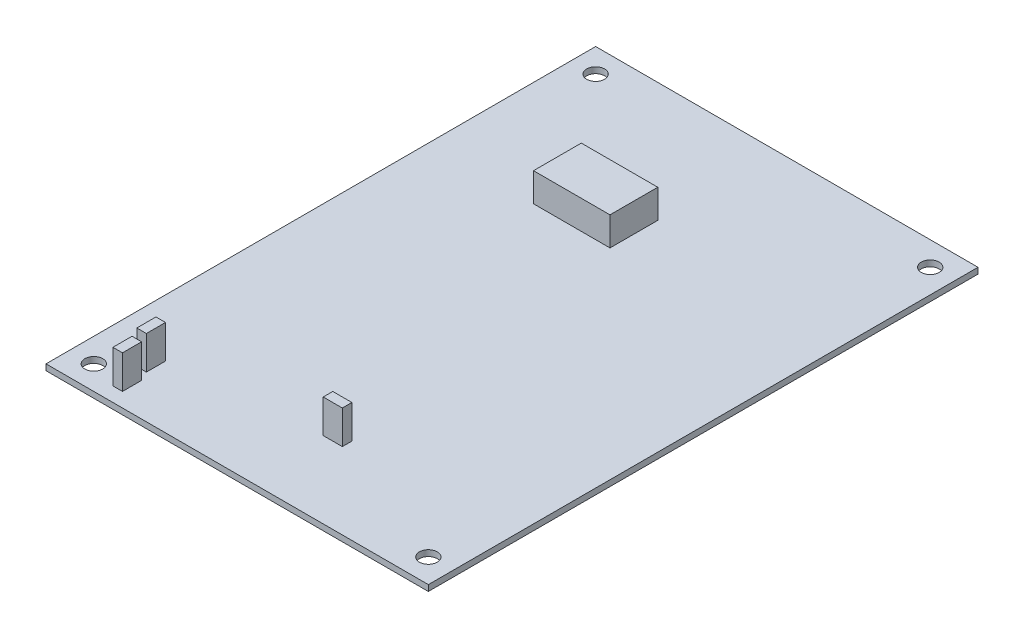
ISO-10303-21;
HEADER;
FILE_DESCRIPTION(('STEP AP214'),'2;1');
FILE_NAME('part.step','',(''),(''),'','','');
FILE_SCHEMA(('AUTOMOTIVE_DESIGN { 1 0 10303 214 1 1 1 1 }'));
ENDSEC;
DATA;
#1=APPLICATION_CONTEXT('core data for automotive mechanical design processes');
#2=APPLICATION_PROTOCOL_DEFINITION('international standard','automotive_design',2000,#1);
#3=PRODUCT_CONTEXT('',#1,'mechanical');
#4=PRODUCT('Part','Part','',(#3));
#5=PRODUCT_RELATED_PRODUCT_CATEGORY('part','',(#4));
#6=PRODUCT_DEFINITION_FORMATION('','',#4);
#7=PRODUCT_DEFINITION_CONTEXT('part definition',#1,'design');
#8=PRODUCT_DEFINITION('design','',#6,#7);
#9=PRODUCT_DEFINITION_SHAPE('','',#8);
#10=(LENGTH_UNIT() NAMED_UNIT(*) SI_UNIT(.MILLI.,.METRE.));
#11=(NAMED_UNIT(*) PLANE_ANGLE_UNIT() SI_UNIT($,.RADIAN.));
#12=(NAMED_UNIT(*) SI_UNIT($,.STERADIAN.) SOLID_ANGLE_UNIT());
#13=UNCERTAINTY_MEASURE_WITH_UNIT(LENGTH_MEASURE(1.E-05),#10,'distance_accuracy_value','');
#14=(GEOMETRIC_REPRESENTATION_CONTEXT(3) GLOBAL_UNCERTAINTY_ASSIGNED_CONTEXT((#13)) GLOBAL_UNIT_ASSIGNED_CONTEXT((#10,
#11,#12)) REPRESENTATION_CONTEXT('',''));
#15=CARTESIAN_POINT('',(0.,0.,0.));
#16=DIRECTION('',(0.,0.,1.));
#17=DIRECTION('',(1.,0.,0.));
#18=AXIS2_PLACEMENT_3D('',#15,#16,#17);
#19=CARTESIAN_POINT('',(-50.8,1.5875,73.025));
#20=DIRECTION('',(0.,1.,0.));
#21=DIRECTION('',(0.,0.,1.));
#22=AXIS2_PLACEMENT_3D('',#19,#20,#21);
#23=PLANE('',#22);
#24=DIRECTION('',(1.,0.,0.));
#25=VECTOR('',#24,1.);
#26=CARTESIAN_POINT('',(-38.1,1.5875,61.595));
#27=LINE('',#26,#25);
#28=CARTESIAN_POINT('',(-38.1,1.5875,61.595));
#29=VERTEX_POINT('',#28);
#30=CARTESIAN_POINT('',(-35.56,1.5875,61.595));
#31=VERTEX_POINT('',#30);
#32=EDGE_CURVE('E213',#29,#31,#27,.T.);
#33=ORIENTED_EDGE('',*,*,#32,.F.);
#34=DIRECTION('',(0.,0.,1.));
#35=VECTOR('',#34,1.);
#36=CARTESIAN_POINT('',(-38.1,1.5875,56.515));
#37=LINE('',#36,#35);
#38=CARTESIAN_POINT('',(-38.1,1.5875,56.515));
#39=VERTEX_POINT('',#38);
#40=EDGE_CURVE('E210',#39,#29,#37,.T.);
#41=ORIENTED_EDGE('',*,*,#40,.F.);
#42=DIRECTION('',(-1.,0.,0.));
#43=VECTOR('',#42,1.);
#44=CARTESIAN_POINT('',(-38.1,1.5875,56.515));
#45=LINE('',#44,#43);
#46=CARTESIAN_POINT('',(-35.56,1.5875,56.515));
#47=VERTEX_POINT('',#46);
#48=EDGE_CURVE('E223',#47,#39,#45,.T.);
#49=ORIENTED_EDGE('',*,*,#48,.F.);
#50=DIRECTION('',(0.,0.,-1.));
#51=VECTOR('',#50,1.);
#52=CARTESIAN_POINT('',(-35.56,1.5875,56.515));
#53=LINE('',#52,#51);
#54=EDGE_CURVE('E233',#31,#47,#53,.T.);
#55=ORIENTED_EDGE('',*,*,#54,.F.);
#56=EDGE_LOOP('',(#33,#41,#49,#55));
#57=FACE_BOUND('',#56,.T.);
#58=DIRECTION('',(1.,0.,0.));
#59=VECTOR('',#58,1.);
#60=CARTESIAN_POINT('',(-22.86,1.5875,-28.575));
#61=LINE('',#60,#59);
#62=CARTESIAN_POINT('',(-22.86,1.5875,-28.575));
#63=VERTEX_POINT('',#62);
#64=CARTESIAN_POINT('',(-2.53999999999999,1.5875,-28.575));
#65=VERTEX_POINT('',#64);
#66=EDGE_CURVE('E297',#63,#65,#61,.T.);
#67=ORIENTED_EDGE('',*,*,#66,.F.);
#68=DIRECTION('',(0.,0.,1.));
#69=VECTOR('',#68,1.);
#70=CARTESIAN_POINT('',(-22.86,1.5875,-41.275));
#71=LINE('',#70,#69);
#72=CARTESIAN_POINT('',(-22.86,1.5875,-41.275));
#73=VERTEX_POINT('',#72);
#74=EDGE_CURVE('E283',#73,#63,#71,.T.);
#75=ORIENTED_EDGE('',*,*,#74,.F.);
#76=DIRECTION('',(-1.,0.,0.));
#77=VECTOR('',#76,1.);
#78=CARTESIAN_POINT('',(-22.86,1.5875,-41.275));
#79=LINE('',#78,#77);
#80=CARTESIAN_POINT('',(-2.53999999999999,1.5875,-41.275));
#81=VERTEX_POINT('',#80);
#82=EDGE_CURVE('E288',#81,#73,#79,.T.);
#83=ORIENTED_EDGE('',*,*,#82,.F.);
#84=DIRECTION('',(0.,0.,-1.));
#85=VECTOR('',#84,1.);
#86=CARTESIAN_POINT('',(-2.53999999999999,1.5875,-41.275));
#87=LINE('',#86,#85);
#88=EDGE_CURVE('E299',#65,#81,#87,.T.);
#89=ORIENTED_EDGE('',*,*,#88,.F.);
#90=EDGE_LOOP('',(#67,#75,#83,#89));
#91=FACE_BOUND('',#90,.T.);
#92=CARTESIAN_POINT('',(44.45,1.5875,66.675));
#93=DIRECTION('',(0.,1.,0.));
#94=DIRECTION('',(0.,0.,1.));
#95=AXIS2_PLACEMENT_3D('',#92,#93,#94);
#96=CIRCLE('',#95,2.38125);
#97=CARTESIAN_POINT('',(44.45,1.5875,69.05625));
#98=VERTEX_POINT('',#97);
#99=EDGE_CURVE('E319',#98,#98,#96,.T.);
#100=ORIENTED_EDGE('',*,*,#99,.F.);
#101=EDGE_LOOP('',(#100));
#102=FACE_BOUND('',#101,.T.);
#103=CARTESIAN_POINT('',(-44.45,1.5875,-66.675));
#104=DIRECTION('',(0.,1.,0.));
#105=DIRECTION('',(0.,0.,1.));
#106=AXIS2_PLACEMENT_3D('',#103,#104,#105);
#107=CIRCLE('',#106,2.38125);
#108=CARTESIAN_POINT('',(-44.45,1.5875,-64.29375));
#109=VERTEX_POINT('',#108);
#110=EDGE_CURVE('E333',#109,#109,#107,.T.);
#111=ORIENTED_EDGE('',*,*,#110,.F.);
#112=EDGE_LOOP('',(#111));
#113=FACE_BOUND('',#112,.T.);
#114=DIRECTION('',(0.,0.,1.));
#115=VECTOR('',#114,1.);
#116=CARTESIAN_POINT('',(-50.8,1.5875,-73.025));
#117=LINE('',#116,#115);
#118=CARTESIAN_POINT('',(-50.8,1.5875,-73.025));
#119=VERTEX_POINT('',#118);
#120=CARTESIAN_POINT('',(-50.8,1.5875,73.025));
#121=VERTEX_POINT('',#120);
#122=EDGE_CURVE('E341',#119,#121,#117,.T.);
#123=ORIENTED_EDGE('',*,*,#122,.T.);
#124=DIRECTION('',(1.,0.,0.));
#125=VECTOR('',#124,1.);
#126=CARTESIAN_POINT('',(-50.8,1.5875,73.025));
#127=LINE('',#126,#125);
#128=CARTESIAN_POINT('',(50.8,1.5875,73.025));
#129=VERTEX_POINT('',#128);
#130=EDGE_CURVE('E345',#121,#129,#127,.T.);
#131=ORIENTED_EDGE('',*,*,#130,.T.);
#132=DIRECTION('',(0.,0.,-1.));
#133=VECTOR('',#132,1.);
#134=CARTESIAN_POINT('',(50.8,1.5875,-73.025));
#135=LINE('',#134,#133);
#136=CARTESIAN_POINT('',(50.8,1.5875,-73.025));
#137=VERTEX_POINT('',#136);
#138=EDGE_CURVE('E348',#129,#137,#135,.T.);
#139=ORIENTED_EDGE('',*,*,#138,.T.);
#140=DIRECTION('',(-1.,0.,0.));
#141=VECTOR('',#140,1.);
#142=CARTESIAN_POINT('',(-50.8,1.5875,-73.025));
#143=LINE('',#142,#141);
#144=EDGE_CURVE('E351',#137,#119,#143,.T.);
#145=ORIENTED_EDGE('',*,*,#144,.T.);
#146=EDGE_LOOP('',(#123,#131,#139,#145));
#147=FACE_BOUND('',#146,.T.);
#148=CARTESIAN_POINT('',(44.45,1.5875,-66.675));
#149=DIRECTION('',(0.,1.,0.));
#150=DIRECTION('',(0.,0.,1.));
#151=AXIS2_PLACEMENT_3D('',#148,#149,#150);
#152=CIRCLE('',#151,2.38125);
#153=CARTESIAN_POINT('',(44.45,1.5875,-64.29375));
#154=VERTEX_POINT('',#153);
#155=EDGE_CURVE('E325',#154,#154,#152,.T.);
#156=ORIENTED_EDGE('',*,*,#155,.F.);
#157=EDGE_LOOP('',(#156));
#158=FACE_BOUND('',#157,.T.);
#159=CARTESIAN_POINT('',(-44.45,1.5875,66.675));
#160=DIRECTION('',(0.,1.,0.));
#161=DIRECTION('',(0.,0.,1.));
#162=AXIS2_PLACEMENT_3D('',#159,#160,#161);
#163=CIRCLE('',#162,2.38125);
#164=CARTESIAN_POINT('',(-44.45,1.5875,69.05625));
#165=VERTEX_POINT('',#164);
#166=EDGE_CURVE('E313',#165,#165,#163,.T.);
#167=ORIENTED_EDGE('',*,*,#166,.F.);
#168=EDGE_LOOP('',(#167));
#169=FACE_BOUND('',#168,.T.);
#170=DIRECTION('',(1.,0.,0.));
#171=VECTOR('',#170,1.);
#172=CARTESIAN_POINT('',(2.54000000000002,1.5875,52.705));
#173=LINE('',#172,#171);
#174=CARTESIAN_POINT('',(2.54000000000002,1.5875,52.705));
#175=VERTEX_POINT('',#174);
#176=CARTESIAN_POINT('',(7.62000000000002,1.5875,52.705));
#177=VERTEX_POINT('',#176);
#178=EDGE_CURVE('E264',#175,#177,#173,.T.);
#179=ORIENTED_EDGE('',*,*,#178,.F.);
#180=DIRECTION('',(0.,0.,1.));
#181=VECTOR('',#180,1.);
#182=CARTESIAN_POINT('',(2.54000000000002,1.5875,50.165));
#183=LINE('',#182,#181);
#184=CARTESIAN_POINT('',(2.54000000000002,1.5875,50.165));
#185=VERTEX_POINT('',#184);
#186=EDGE_CURVE('E246',#185,#175,#183,.T.);
#187=ORIENTED_EDGE('',*,*,#186,.F.);
#188=DIRECTION('',(-1.,0.,0.));
#189=VECTOR('',#188,1.);
#190=CARTESIAN_POINT('',(2.54000000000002,1.5875,50.165));
#191=LINE('',#190,#189);
#192=CARTESIAN_POINT('',(7.62000000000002,1.5875,50.165));
#193=VERTEX_POINT('',#192);
#194=EDGE_CURVE('E252',#193,#185,#191,.T.);
#195=ORIENTED_EDGE('',*,*,#194,.F.);
#196=DIRECTION('',(0.,0.,-1.));
#197=VECTOR('',#196,1.);
#198=CARTESIAN_POINT('',(7.62000000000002,1.5875,50.165));
#199=LINE('',#198,#197);
#200=EDGE_CURVE('E266',#177,#193,#199,.T.);
#201=ORIENTED_EDGE('',*,*,#200,.F.);
#202=EDGE_LOOP('',(#179,#187,#195,#201));
#203=FACE_BOUND('',#202,.T.);
#204=DIRECTION('',(1.,0.,0.));
#205=VECTOR('',#204,1.);
#206=CARTESIAN_POINT('',(-36.83,1.5875,69.215));
#207=LINE('',#206,#205);
#208=CARTESIAN_POINT('',(-36.83,1.5875,69.215));
#209=VERTEX_POINT('',#208);
#210=CARTESIAN_POINT('',(-34.29,1.5875,69.215));
#211=VERTEX_POINT('',#210);
#212=EDGE_CURVE('E685',#209,#211,#207,.T.);
#213=ORIENTED_EDGE('',*,*,#212,.F.);
#214=DIRECTION('',(0.,0.,1.));
#215=VECTOR('',#214,1.);
#216=CARTESIAN_POINT('',(-36.83,1.5875,64.135));
#217=LINE('',#216,#215);
#218=CARTESIAN_POINT('',(-36.83,1.5875,64.135));
#219=VERTEX_POINT('',#218);
#220=EDGE_CURVE('E208',#219,#209,#217,.T.);
#221=ORIENTED_EDGE('',*,*,#220,.F.);
#222=DIRECTION('',(-1.,0.,0.));
#223=VECTOR('',#222,1.);
#224=CARTESIAN_POINT('',(-36.83,1.5875,64.135));
#225=LINE('',#224,#223);
#226=CARTESIAN_POINT('',(-34.29,1.5875,64.135));
#227=VERTEX_POINT('',#226);
#228=EDGE_CURVE('E204',#227,#219,#225,.T.);
#229=ORIENTED_EDGE('',*,*,#228,.F.);
#230=DIRECTION('',(0.,0.,-1.));
#231=VECTOR('',#230,1.);
#232=CARTESIAN_POINT('',(-34.29,1.5875,64.135));
#233=LINE('',#232,#231);
#234=EDGE_CURVE('E682',#211,#227,#233,.T.);
#235=ORIENTED_EDGE('',*,*,#234,.F.);
#236=EDGE_LOOP('',(#213,#221,#229,#235));
#237=FACE_BOUND('',#236,.T.);
#238=ADVANCED_FACE('F41',(#57,#91,#102,#113,#147,#158,#169,#203,#237),#23,.T.);
#239=CARTESIAN_POINT('',(-50.8,0.,73.025));
#240=DIRECTION('',(0.,1.,0.));
#241=DIRECTION('',(0.,0.,1.));
#242=AXIS2_PLACEMENT_3D('',#239,#240,#241);
#243=PLANE('',#242);
#244=CARTESIAN_POINT('',(44.45,0.,66.675));
#245=DIRECTION('',(0.,1.,0.));
#246=DIRECTION('',(0.,0.,1.));
#247=AXIS2_PLACEMENT_3D('',#244,#245,#246);
#248=CIRCLE('',#247,2.38125);
#249=CARTESIAN_POINT('',(44.45,0.,69.05625));
#250=VERTEX_POINT('',#249);
#251=EDGE_CURVE('E316',#250,#250,#248,.T.);
#252=ORIENTED_EDGE('',*,*,#251,.T.);
#253=EDGE_LOOP('',(#252));
#254=FACE_BOUND('',#253,.T.);
#255=CARTESIAN_POINT('',(-44.45,0.,-66.675));
#256=DIRECTION('',(0.,1.,0.));
#257=DIRECTION('',(0.,0.,1.));
#258=AXIS2_PLACEMENT_3D('',#255,#256,#257);
#259=CIRCLE('',#258,2.38125);
#260=CARTESIAN_POINT('',(-44.45,0.,-64.29375));
#261=VERTEX_POINT('',#260);
#262=EDGE_CURVE('E329',#261,#261,#259,.T.);
#263=ORIENTED_EDGE('',*,*,#262,.T.);
#264=EDGE_LOOP('',(#263));
#265=FACE_BOUND('',#264,.T.);
#266=DIRECTION('',(0.,0.,1.));
#267=VECTOR('',#266,1.);
#268=CARTESIAN_POINT('',(-50.8,0.,-73.025));
#269=LINE('',#268,#267);
#270=CARTESIAN_POINT('',(-50.8,0.,-73.025));
#271=VERTEX_POINT('',#270);
#272=CARTESIAN_POINT('',(-50.8,0.,73.025));
#273=VERTEX_POINT('',#272);
#274=EDGE_CURVE('E337',#271,#273,#269,.T.);
#275=ORIENTED_EDGE('',*,*,#274,.F.);
#276=DIRECTION('',(-1.,0.,0.));
#277=VECTOR('',#276,1.);
#278=CARTESIAN_POINT('',(-50.8,0.,-73.025));
#279=LINE('',#278,#277);
#280=CARTESIAN_POINT('',(50.8,0.,-73.025));
#281=VERTEX_POINT('',#280);
#282=EDGE_CURVE('E346',#281,#271,#279,.T.);
#283=ORIENTED_EDGE('',*,*,#282,.F.);
#284=DIRECTION('',(0.,0.,-1.));
#285=VECTOR('',#284,1.);
#286=CARTESIAN_POINT('',(50.8,0.,-73.025));
#287=LINE('',#286,#285);
#288=CARTESIAN_POINT('',(50.8,0.,73.025));
#289=VERTEX_POINT('',#288);
#290=EDGE_CURVE('E359',#289,#281,#287,.T.);
#291=ORIENTED_EDGE('',*,*,#290,.F.);
#292=DIRECTION('',(1.,0.,0.));
#293=VECTOR('',#292,1.);
#294=CARTESIAN_POINT('',(-50.8,0.,73.025));
#295=LINE('',#294,#293);
#296=EDGE_CURVE('E357',#273,#289,#295,.T.);
#297=ORIENTED_EDGE('',*,*,#296,.F.);
#298=EDGE_LOOP('',(#275,#283,#291,#297));
#299=FACE_BOUND('',#298,.T.);
#300=CARTESIAN_POINT('',(44.45,0.,-66.675));
#301=DIRECTION('',(0.,1.,0.));
#302=DIRECTION('',(0.,0.,1.));
#303=AXIS2_PLACEMENT_3D('',#300,#301,#302);
#304=CIRCLE('',#303,2.38125);
#305=CARTESIAN_POINT('',(44.45,0.,-64.29375));
#306=VERTEX_POINT('',#305);
#307=EDGE_CURVE('E322',#306,#306,#304,.T.);
#308=ORIENTED_EDGE('',*,*,#307,.T.);
#309=EDGE_LOOP('',(#308));
#310=FACE_BOUND('',#309,.T.);
#311=CARTESIAN_POINT('',(-44.45,0.,66.675));
#312=DIRECTION('',(0.,1.,0.));
#313=DIRECTION('',(0.,0.,1.));
#314=AXIS2_PLACEMENT_3D('',#311,#312,#313);
#315=CIRCLE('',#314,2.38125);
#316=CARTESIAN_POINT('',(-44.45,0.,69.05625));
#317=VERTEX_POINT('',#316);
#318=EDGE_CURVE('E312',#317,#317,#315,.T.);
#319=ORIENTED_EDGE('',*,*,#318,.T.);
#320=EDGE_LOOP('',(#319));
#321=FACE_BOUND('',#320,.T.);
#322=ADVANCED_FACE('F378',(#254,#265,#299,#310,#321),#243,.F.);
#323=CARTESIAN_POINT('',(-50.8,1.5875,-73.025));
#324=DIRECTION('',(1.,0.,0.));
#325=DIRECTION('',(0.,0.,-1.));
#326=AXIS2_PLACEMENT_3D('',#323,#324,#325);
#327=PLANE('',#326);
#328=ORIENTED_EDGE('',*,*,#274,.T.);
#329=DIRECTION('',(0.,-1.,0.));
#330=VECTOR('',#329,1.);
#331=CARTESIAN_POINT('',(-50.8,1.5875,73.025));
#332=LINE('',#331,#330);
#333=EDGE_CURVE('E11',#121,#273,#332,.T.);
#334=ORIENTED_EDGE('',*,*,#333,.F.);
#335=ORIENTED_EDGE('',*,*,#122,.F.);
#336=DIRECTION('',(0.,-1.,0.));
#337=VECTOR('',#336,1.);
#338=CARTESIAN_POINT('',(-50.8,1.5875,-73.025));
#339=LINE('',#338,#337);
#340=EDGE_CURVE('E353',#119,#271,#339,.T.);
#341=ORIENTED_EDGE('',*,*,#340,.T.);
#342=EDGE_LOOP('',(#328,#334,#335,#341));
#343=FACE_BOUND('',#342,.T.);
#344=ADVANCED_FACE('F43',(#343),#327,.F.);
#345=CARTESIAN_POINT('',(-50.8,1.5875,73.025));
#346=DIRECTION('',(0.,0.,-1.));
#347=DIRECTION('',(-1.,0.,0.));
#348=AXIS2_PLACEMENT_3D('',#345,#346,#347);
#349=PLANE('',#348);
#350=ORIENTED_EDGE('',*,*,#296,.T.);
#351=DIRECTION('',(0.,-1.,0.));
#352=VECTOR('',#351,1.);
#353=CARTESIAN_POINT('',(50.8,1.5875,73.025));
#354=LINE('',#353,#352);
#355=EDGE_CURVE('E49',#129,#289,#354,.T.);
#356=ORIENTED_EDGE('',*,*,#355,.F.);
#357=ORIENTED_EDGE('',*,*,#130,.F.);
#358=ORIENTED_EDGE('',*,*,#333,.T.);
#359=EDGE_LOOP('',(#350,#356,#357,#358));
#360=FACE_BOUND('',#359,.T.);
#361=ADVANCED_FACE('F389',(#360),#349,.F.);
#362=CARTESIAN_POINT('',(50.8,1.5875,-73.025));
#363=DIRECTION('',(-1.,0.,0.));
#364=DIRECTION('',(0.,0.,1.));
#365=AXIS2_PLACEMENT_3D('',#362,#363,#364);
#366=PLANE('',#365);
#367=ORIENTED_EDGE('',*,*,#290,.T.);
#368=DIRECTION('',(0.,-1.,0.));
#369=VECTOR('',#368,1.);
#370=CARTESIAN_POINT('',(50.8,1.5875,-73.025));
#371=LINE('',#370,#369);
#372=EDGE_CURVE('E365',#137,#281,#371,.T.);
#373=ORIENTED_EDGE('',*,*,#372,.F.);
#374=ORIENTED_EDGE('',*,*,#138,.F.);
#375=ORIENTED_EDGE('',*,*,#355,.T.);
#376=EDGE_LOOP('',(#367,#373,#374,#375));
#377=FACE_BOUND('',#376,.T.);
#378=ADVANCED_FACE('F372',(#377),#366,.F.);
#379=CARTESIAN_POINT('',(-50.8,1.5875,-73.025));
#380=DIRECTION('',(0.,0.,1.));
#381=DIRECTION('',(1.,0.,0.));
#382=AXIS2_PLACEMENT_3D('',#379,#380,#381);
#383=PLANE('',#382);
#384=ORIENTED_EDGE('',*,*,#282,.T.);
#385=ORIENTED_EDGE('',*,*,#340,.F.);
#386=ORIENTED_EDGE('',*,*,#144,.F.);
#387=ORIENTED_EDGE('',*,*,#372,.T.);
#388=EDGE_LOOP('',(#384,#385,#386,#387));
#389=FACE_BOUND('',#388,.T.);
#390=ADVANCED_FACE('F382',(#389),#383,.F.);
#391=CARTESIAN_POINT('',(-44.45,1.5875,-66.675));
#392=DIRECTION('',(0.,-1.,0.));
#393=DIRECTION('',(0.,0.,-1.));
#394=AXIS2_PLACEMENT_3D('',#391,#392,#393);
#395=CYLINDRICAL_SURFACE('',#394,2.38125);
#396=ORIENTED_EDGE('',*,*,#110,.T.);
#397=EDGE_LOOP('',(#396));
#398=FACE_BOUND('',#397,.T.);
#399=ORIENTED_EDGE('',*,*,#262,.F.);
#400=EDGE_LOOP('',(#399));
#401=FACE_BOUND('',#400,.T.);
#402=ADVANCED_FACE('F407',(#398,#401),#395,.F.);
#403=CARTESIAN_POINT('',(44.45,1.5875,-66.675));
#404=DIRECTION('',(0.,-1.,0.));
#405=DIRECTION('',(0.,0.,-1.));
#406=AXIS2_PLACEMENT_3D('',#403,#404,#405);
#407=CYLINDRICAL_SURFACE('',#406,2.38125);
#408=ORIENTED_EDGE('',*,*,#155,.T.);
#409=EDGE_LOOP('',(#408));
#410=FACE_BOUND('',#409,.T.);
#411=ORIENTED_EDGE('',*,*,#307,.F.);
#412=EDGE_LOOP('',(#411));
#413=FACE_BOUND('',#412,.T.);
#414=ADVANCED_FACE('F414',(#410,#413),#407,.F.);
#415=CARTESIAN_POINT('',(44.45,1.5875,66.675));
#416=DIRECTION('',(0.,-1.,0.));
#417=DIRECTION('',(0.,0.,-1.));
#418=AXIS2_PLACEMENT_3D('',#415,#416,#417);
#419=CYLINDRICAL_SURFACE('',#418,2.38125);
#420=ORIENTED_EDGE('',*,*,#99,.T.);
#421=EDGE_LOOP('',(#420));
#422=FACE_BOUND('',#421,.T.);
#423=ORIENTED_EDGE('',*,*,#251,.F.);
#424=EDGE_LOOP('',(#423));
#425=FACE_BOUND('',#424,.T.);
#426=ADVANCED_FACE('F419',(#422,#425),#419,.F.);
#427=CARTESIAN_POINT('',(-44.45,1.5875,66.675));
#428=DIRECTION('',(0.,-1.,0.));
#429=DIRECTION('',(0.,0.,-1.));
#430=AXIS2_PLACEMENT_3D('',#427,#428,#429);
#431=CYLINDRICAL_SURFACE('',#430,2.38125);
#432=ORIENTED_EDGE('',*,*,#166,.T.);
#433=EDGE_LOOP('',(#432));
#434=FACE_BOUND('',#433,.T.);
#435=ORIENTED_EDGE('',*,*,#318,.F.);
#436=EDGE_LOOP('',(#435));
#437=FACE_BOUND('',#436,.T.);
#438=ADVANCED_FACE('F429',(#434,#437),#431,.F.);
#439=CARTESIAN_POINT('',(-22.86,9.2075,-41.275));
#440=DIRECTION('',(1.,0.,0.));
#441=DIRECTION('',(0.,0.,-1.));
#442=AXIS2_PLACEMENT_3D('',#439,#440,#441);
#443=PLANE('',#442);
#444=ORIENTED_EDGE('',*,*,#74,.T.);
#445=DIRECTION('',(0.,-1.,0.));
#446=VECTOR('',#445,1.);
#447=CARTESIAN_POINT('',(-22.86,9.2075,-28.575));
#448=LINE('',#447,#446);
#449=CARTESIAN_POINT('',(-22.86,9.2075,-28.575));
#450=VERTEX_POINT('',#449);
#451=EDGE_CURVE('E310',#450,#63,#448,.T.);
#452=ORIENTED_EDGE('',*,*,#451,.F.);
#453=DIRECTION('',(0.,0.,1.));
#454=VECTOR('',#453,1.);
#455=CARTESIAN_POINT('',(-22.86,9.2075,-41.275));
#456=LINE('',#455,#454);
#457=CARTESIAN_POINT('',(-22.86,9.2075,-41.275));
#458=VERTEX_POINT('',#457);
#459=EDGE_CURVE('E284',#458,#450,#456,.T.);
#460=ORIENTED_EDGE('',*,*,#459,.F.);
#461=DIRECTION('',(0.,-1.,0.));
#462=VECTOR('',#461,1.);
#463=CARTESIAN_POINT('',(-22.86,9.2075,-41.275));
#464=LINE('',#463,#462);
#465=EDGE_CURVE('E294',#458,#73,#464,.T.);
#466=ORIENTED_EDGE('',*,*,#465,.T.);
#467=EDGE_LOOP('',(#444,#452,#460,#466));
#468=FACE_BOUND('',#467,.T.);
#469=ADVANCED_FACE('F436',(#468),#443,.F.);
#470=CARTESIAN_POINT('',(-22.86,9.2075,-28.575));
#471=DIRECTION('',(0.,0.,-1.));
#472=DIRECTION('',(-1.,0.,0.));
#473=AXIS2_PLACEMENT_3D('',#470,#471,#472);
#474=PLANE('',#473);
#475=ORIENTED_EDGE('',*,*,#66,.T.);
#476=DIRECTION('',(0.,-1.,0.));
#477=VECTOR('',#476,1.);
#478=CARTESIAN_POINT('',(-2.53999999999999,9.2075,-28.575));
#479=LINE('',#478,#477);
#480=CARTESIAN_POINT('',(-2.53999999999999,9.2075,-28.575));
#481=VERTEX_POINT('',#480);
#482=EDGE_CURVE('E307',#481,#65,#479,.T.);
#483=ORIENTED_EDGE('',*,*,#482,.F.);
#484=DIRECTION('',(1.,0.,0.));
#485=VECTOR('',#484,1.);
#486=CARTESIAN_POINT('',(-22.86,9.2075,-28.575));
#487=LINE('',#486,#485);
#488=EDGE_CURVE('E287',#450,#481,#487,.T.);
#489=ORIENTED_EDGE('',*,*,#488,.F.);
#490=ORIENTED_EDGE('',*,*,#451,.T.);
#491=EDGE_LOOP('',(#475,#483,#489,#490));
#492=FACE_BOUND('',#491,.T.);
#493=ADVANCED_FACE('F440',(#492),#474,.F.);
#494=CARTESIAN_POINT('',(-2.53999999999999,9.2075,-41.275));
#495=DIRECTION('',(-1.,0.,0.));
#496=DIRECTION('',(0.,0.,1.));
#497=AXIS2_PLACEMENT_3D('',#494,#495,#496);
#498=PLANE('',#497);
#499=ORIENTED_EDGE('',*,*,#88,.T.);
#500=DIRECTION('',(0.,-1.,0.));
#501=VECTOR('',#500,1.);
#502=CARTESIAN_POINT('',(-2.53999999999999,9.2075,-41.275));
#503=LINE('',#502,#501);
#504=CARTESIAN_POINT('',(-2.53999999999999,9.2075,-41.275));
#505=VERTEX_POINT('',#504);
#506=EDGE_CURVE('E305',#505,#81,#503,.T.);
#507=ORIENTED_EDGE('',*,*,#506,.F.);
#508=DIRECTION('',(0.,0.,-1.));
#509=VECTOR('',#508,1.);
#510=CARTESIAN_POINT('',(-2.53999999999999,9.2075,-41.275));
#511=LINE('',#510,#509);
#512=EDGE_CURVE('E290',#481,#505,#511,.T.);
#513=ORIENTED_EDGE('',*,*,#512,.F.);
#514=ORIENTED_EDGE('',*,*,#482,.T.);
#515=EDGE_LOOP('',(#499,#507,#513,#514));
#516=FACE_BOUND('',#515,.T.);
#517=ADVANCED_FACE('F444',(#516),#498,.F.);
#518=CARTESIAN_POINT('',(-22.86,9.2075,-41.275));
#519=DIRECTION('',(0.,0.,1.));
#520=DIRECTION('',(1.,0.,0.));
#521=AXIS2_PLACEMENT_3D('',#518,#519,#520);
#522=PLANE('',#521);
#523=ORIENTED_EDGE('',*,*,#82,.T.);
#524=ORIENTED_EDGE('',*,*,#465,.F.);
#525=DIRECTION('',(-1.,0.,0.));
#526=VECTOR('',#525,1.);
#527=CARTESIAN_POINT('',(-22.86,9.2075,-41.275));
#528=LINE('',#527,#526);
#529=EDGE_CURVE('E292',#505,#458,#528,.T.);
#530=ORIENTED_EDGE('',*,*,#529,.F.);
#531=ORIENTED_EDGE('',*,*,#506,.T.);
#532=EDGE_LOOP('',(#523,#524,#530,#531));
#533=FACE_BOUND('',#532,.T.);
#534=ADVANCED_FACE('F448',(#533),#522,.F.);
#535=CARTESIAN_POINT('',(0.,9.2075,0.));
#536=DIRECTION('',(0.,1.,0.));
#537=DIRECTION('',(0.,0.,1.));
#538=AXIS2_PLACEMENT_3D('',#535,#536,#537);
#539=PLANE('',#538);
#540=ORIENTED_EDGE('',*,*,#459,.T.);
#541=ORIENTED_EDGE('',*,*,#488,.T.);
#542=ORIENTED_EDGE('',*,*,#512,.T.);
#543=ORIENTED_EDGE('',*,*,#529,.T.);
#544=EDGE_LOOP('',(#540,#541,#542,#543));
#545=FACE_BOUND('',#544,.T.);
#546=ADVANCED_FACE('F452',(#545),#539,.T.);
#547=CARTESIAN_POINT('',(2.54000000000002,10.4775,50.165));
#548=DIRECTION('',(1.,0.,0.));
#549=DIRECTION('',(0.,0.,-1.));
#550=AXIS2_PLACEMENT_3D('',#547,#548,#549);
#551=PLANE('',#550);
#552=ORIENTED_EDGE('',*,*,#186,.T.);
#553=DIRECTION('',(0.,-1.,0.));
#554=VECTOR('',#553,1.);
#555=CARTESIAN_POINT('',(2.54000000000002,10.4775,52.705));
#556=LINE('',#555,#554);
#557=CARTESIAN_POINT('',(2.54000000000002,10.4775,52.705));
#558=VERTEX_POINT('',#557);
#559=EDGE_CURVE('E280',#558,#175,#556,.T.);
#560=ORIENTED_EDGE('',*,*,#559,.F.);
#561=DIRECTION('',(0.,0.,1.));
#562=VECTOR('',#561,1.);
#563=CARTESIAN_POINT('',(2.54000000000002,10.4775,50.165));
#564=LINE('',#563,#562);
#565=CARTESIAN_POINT('',(2.54000000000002,10.4775,50.165));
#566=VERTEX_POINT('',#565);
#567=EDGE_CURVE('E247',#566,#558,#564,.T.);
#568=ORIENTED_EDGE('',*,*,#567,.F.);
#569=DIRECTION('',(0.,-1.,0.));
#570=VECTOR('',#569,1.);
#571=CARTESIAN_POINT('',(2.54000000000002,10.4775,50.165));
#572=LINE('',#571,#570);
#573=EDGE_CURVE('E261',#566,#185,#572,.T.);
#574=ORIENTED_EDGE('',*,*,#573,.T.);
#575=EDGE_LOOP('',(#552,#560,#568,#574));
#576=FACE_BOUND('',#575,.T.);
#577=ADVANCED_FACE('F456',(#576),#551,.F.);
#578=CARTESIAN_POINT('',(2.54000000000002,10.4775,52.705));
#579=DIRECTION('',(0.,0.,-1.));
#580=DIRECTION('',(-1.,0.,0.));
#581=AXIS2_PLACEMENT_3D('',#578,#579,#580);
#582=PLANE('',#581);
#583=ORIENTED_EDGE('',*,*,#178,.T.);
#584=DIRECTION('',(0.,-1.,0.));
#585=VECTOR('',#584,1.);
#586=CARTESIAN_POINT('',(7.62000000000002,10.4775,52.705));
#587=LINE('',#586,#585);
#588=CARTESIAN_POINT('',(7.62000000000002,10.4775,52.705));
#589=VERTEX_POINT('',#588);
#590=EDGE_CURVE('E276',#589,#177,#587,.T.);
#591=ORIENTED_EDGE('',*,*,#590,.F.);
#592=DIRECTION('',(1.,0.,0.));
#593=VECTOR('',#592,1.);
#594=CARTESIAN_POINT('',(2.54000000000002,10.4775,52.705));
#595=LINE('',#594,#593);
#596=EDGE_CURVE('E251',#558,#589,#595,.T.);
#597=ORIENTED_EDGE('',*,*,#596,.F.);
#598=ORIENTED_EDGE('',*,*,#559,.T.);
#599=EDGE_LOOP('',(#583,#591,#597,#598));
#600=FACE_BOUND('',#599,.T.);
#601=ADVANCED_FACE('F460',(#600),#582,.F.);
#602=CARTESIAN_POINT('',(7.62000000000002,10.4775,50.165));
#603=DIRECTION('',(-1.,0.,0.));
#604=DIRECTION('',(0.,0.,1.));
#605=AXIS2_PLACEMENT_3D('',#602,#603,#604);
#606=PLANE('',#605);
#607=ORIENTED_EDGE('',*,*,#200,.T.);
#608=DIRECTION('',(0.,-1.,0.));
#609=VECTOR('',#608,1.);
#610=CARTESIAN_POINT('',(7.62000000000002,10.4775,50.165));
#611=LINE('',#610,#609);
#612=CARTESIAN_POINT('',(7.62000000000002,10.4775,50.165));
#613=VERTEX_POINT('',#612);
#614=EDGE_CURVE('E273',#613,#193,#611,.T.);
#615=ORIENTED_EDGE('',*,*,#614,.F.);
#616=DIRECTION('',(0.,0.,-1.));
#617=VECTOR('',#616,1.);
#618=CARTESIAN_POINT('',(7.62000000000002,10.4775,50.165));
#619=LINE('',#618,#617);
#620=EDGE_CURVE('E255',#589,#613,#619,.T.);
#621=ORIENTED_EDGE('',*,*,#620,.F.);
#622=ORIENTED_EDGE('',*,*,#590,.T.);
#623=EDGE_LOOP('',(#607,#615,#621,#622));
#624=FACE_BOUND('',#623,.T.);
#625=ADVANCED_FACE('F464',(#624),#606,.F.);
#626=CARTESIAN_POINT('',(2.54000000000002,10.4775,50.165));
#627=DIRECTION('',(0.,0.,1.));
#628=DIRECTION('',(1.,0.,0.));
#629=AXIS2_PLACEMENT_3D('',#626,#627,#628);
#630=PLANE('',#629);
#631=ORIENTED_EDGE('',*,*,#194,.T.);
#632=ORIENTED_EDGE('',*,*,#573,.F.);
#633=DIRECTION('',(-1.,0.,0.));
#634=VECTOR('',#633,1.);
#635=CARTESIAN_POINT('',(2.54000000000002,10.4775,50.165));
#636=LINE('',#635,#634);
#637=EDGE_CURVE('E258',#613,#566,#636,.T.);
#638=ORIENTED_EDGE('',*,*,#637,.F.);
#639=ORIENTED_EDGE('',*,*,#614,.T.);
#640=EDGE_LOOP('',(#631,#632,#638,#639));
#641=FACE_BOUND('',#640,.T.);
#642=ADVANCED_FACE('F468',(#641),#630,.F.);
#643=CARTESIAN_POINT('',(0.,10.4775,0.));
#644=DIRECTION('',(0.,1.,0.));
#645=DIRECTION('',(0.,0.,1.));
#646=AXIS2_PLACEMENT_3D('',#643,#644,#645);
#647=PLANE('',#646);
#648=ORIENTED_EDGE('',*,*,#567,.T.);
#649=ORIENTED_EDGE('',*,*,#596,.T.);
#650=ORIENTED_EDGE('',*,*,#620,.T.);
#651=ORIENTED_EDGE('',*,*,#637,.T.);
#652=EDGE_LOOP('',(#648,#649,#650,#651));
#653=FACE_BOUND('',#652,.T.);
#654=ADVANCED_FACE('F472',(#653),#647,.T.);
#655=CARTESIAN_POINT('',(-38.1,10.4775,56.515));
#656=DIRECTION('',(1.,0.,0.));
#657=DIRECTION('',(0.,0.,-1.));
#658=AXIS2_PLACEMENT_3D('',#655,#656,#657);
#659=PLANE('',#658);
#660=ORIENTED_EDGE('',*,*,#40,.T.);
#661=DIRECTION('',(0.,-1.,0.));
#662=VECTOR('',#661,1.);
#663=CARTESIAN_POINT('',(-38.1,10.4775,61.595));
#664=LINE('',#663,#662);
#665=CARTESIAN_POINT('',(-38.1,10.4775,61.595));
#666=VERTEX_POINT('',#665);
#667=EDGE_CURVE('E244',#666,#29,#664,.T.);
#668=ORIENTED_EDGE('',*,*,#667,.F.);
#669=DIRECTION('',(0.,0.,1.));
#670=VECTOR('',#669,1.);
#671=CARTESIAN_POINT('',(-38.1,10.4775,56.515));
#672=LINE('',#671,#670);
#673=CARTESIAN_POINT('',(-38.1,10.4775,56.515));
#674=VERTEX_POINT('',#673);
#675=EDGE_CURVE('E218',#674,#666,#672,.T.);
#676=ORIENTED_EDGE('',*,*,#675,.F.);
#677=DIRECTION('',(0.,-1.,0.));
#678=VECTOR('',#677,1.);
#679=CARTESIAN_POINT('',(-38.1,10.4775,56.515));
#680=LINE('',#679,#678);
#681=EDGE_CURVE('E230',#674,#39,#680,.T.);
#682=ORIENTED_EDGE('',*,*,#681,.T.);
#683=EDGE_LOOP('',(#660,#668,#676,#682));
#684=FACE_BOUND('',#683,.T.);
#685=ADVANCED_FACE('F476',(#684),#659,.F.);
#686=CARTESIAN_POINT('',(-38.1,10.4775,61.595));
#687=DIRECTION('',(0.,0.,-1.));
#688=DIRECTION('',(-1.,0.,0.));
#689=AXIS2_PLACEMENT_3D('',#686,#687,#688);
#690=PLANE('',#689);
#691=ORIENTED_EDGE('',*,*,#32,.T.);
#692=DIRECTION('',(0.,-1.,0.));
#693=VECTOR('',#692,1.);
#694=CARTESIAN_POINT('',(-35.56,10.4775,61.595));
#695=LINE('',#694,#693);
#696=CARTESIAN_POINT('',(-35.56,10.4775,61.595));
#697=VERTEX_POINT('',#696);
#698=EDGE_CURVE('E241',#697,#31,#695,.T.);
#699=ORIENTED_EDGE('',*,*,#698,.F.);
#700=DIRECTION('',(1.,0.,0.));
#701=VECTOR('',#700,1.);
#702=CARTESIAN_POINT('',(-38.1,10.4775,61.595));
#703=LINE('',#702,#701);
#704=EDGE_CURVE('E222',#666,#697,#703,.T.);
#705=ORIENTED_EDGE('',*,*,#704,.F.);
#706=ORIENTED_EDGE('',*,*,#667,.T.);
#707=EDGE_LOOP('',(#691,#699,#705,#706));
#708=FACE_BOUND('',#707,.T.);
#709=ADVANCED_FACE('F480',(#708),#690,.F.);
#710=CARTESIAN_POINT('',(-35.56,10.4775,56.515));
#711=DIRECTION('',(-1.,0.,0.));
#712=DIRECTION('',(0.,0.,1.));
#713=AXIS2_PLACEMENT_3D('',#710,#711,#712);
#714=PLANE('',#713);
#715=ORIENTED_EDGE('',*,*,#54,.T.);
#716=DIRECTION('',(0.,-1.,0.));
#717=VECTOR('',#716,1.);
#718=CARTESIAN_POINT('',(-35.56,10.4775,56.515));
#719=LINE('',#718,#717);
#720=CARTESIAN_POINT('',(-35.56,10.4775,56.515));
#721=VERTEX_POINT('',#720);
#722=EDGE_CURVE('E64',#721,#47,#719,.T.);
#723=ORIENTED_EDGE('',*,*,#722,.F.);
#724=DIRECTION('',(0.,0.,-1.));
#725=VECTOR('',#724,1.);
#726=CARTESIAN_POINT('',(-35.56,10.4775,56.515));
#727=LINE('',#726,#725);
#728=EDGE_CURVE('E225',#697,#721,#727,.T.);
#729=ORIENTED_EDGE('',*,*,#728,.F.);
#730=ORIENTED_EDGE('',*,*,#698,.T.);
#731=EDGE_LOOP('',(#715,#723,#729,#730));
#732=FACE_BOUND('',#731,.T.);
#733=ADVANCED_FACE('F484',(#732),#714,.F.);
#734=CARTESIAN_POINT('',(-38.1,10.4775,56.515));
#735=DIRECTION('',(0.,0.,1.));
#736=DIRECTION('',(1.,0.,0.));
#737=AXIS2_PLACEMENT_3D('',#734,#735,#736);
#738=PLANE('',#737);
#739=ORIENTED_EDGE('',*,*,#48,.T.);
#740=ORIENTED_EDGE('',*,*,#681,.F.);
#741=DIRECTION('',(-1.,0.,0.));
#742=VECTOR('',#741,1.);
#743=CARTESIAN_POINT('',(-38.1,10.4775,56.515));
#744=LINE('',#743,#742);
#745=EDGE_CURVE('E228',#721,#674,#744,.T.);
#746=ORIENTED_EDGE('',*,*,#745,.F.);
#747=ORIENTED_EDGE('',*,*,#722,.T.);
#748=EDGE_LOOP('',(#739,#740,#746,#747));
#749=FACE_BOUND('',#748,.T.);
#750=ADVANCED_FACE('F488',(#749),#738,.F.);
#751=CARTESIAN_POINT('',(0.,10.4775,0.));
#752=DIRECTION('',(0.,1.,0.));
#753=DIRECTION('',(0.,0.,1.));
#754=AXIS2_PLACEMENT_3D('',#751,#752,#753);
#755=PLANE('',#754);
#756=ORIENTED_EDGE('',*,*,#675,.T.);
#757=ORIENTED_EDGE('',*,*,#704,.T.);
#758=ORIENTED_EDGE('',*,*,#728,.T.);
#759=ORIENTED_EDGE('',*,*,#745,.T.);
#760=EDGE_LOOP('',(#756,#757,#758,#759));
#761=FACE_BOUND('',#760,.T.);
#762=ADVANCED_FACE('F492',(#761),#755,.T.);
#763=CARTESIAN_POINT('',(-36.83,10.4775,64.135));
#764=DIRECTION('',(1.,0.,0.));
#765=DIRECTION('',(0.,0.,-1.));
#766=AXIS2_PLACEMENT_3D('',#763,#764,#765);
#767=PLANE('',#766);
#768=ORIENTED_EDGE('',*,*,#220,.T.);
#769=DIRECTION('',(0.,-1.,0.));
#770=VECTOR('',#769,1.);
#771=CARTESIAN_POINT('',(-36.83,10.4775,69.215));
#772=LINE('',#771,#770);
#773=CARTESIAN_POINT('',(-36.83,10.4775,69.215));
#774=VERTEX_POINT('',#773);
#775=EDGE_CURVE('E189',#774,#209,#772,.T.);
#776=ORIENTED_EDGE('',*,*,#775,.F.);
#777=DIRECTION('',(0.,0.,1.));
#778=VECTOR('',#777,1.);
#779=CARTESIAN_POINT('',(-36.83,10.4775,64.135));
#780=LINE('',#779,#778);
#781=CARTESIAN_POINT('',(-36.83,10.4775,64.135));
#782=VERTEX_POINT('',#781);
#783=EDGE_CURVE('E196',#782,#774,#780,.T.);
#784=ORIENTED_EDGE('',*,*,#783,.F.);
#785=DIRECTION('',(0.,-1.,0.));
#786=VECTOR('',#785,1.);
#787=CARTESIAN_POINT('',(-36.83,10.4775,64.135));
#788=LINE('',#787,#786);
#789=EDGE_CURVE('E679',#782,#219,#788,.T.);
#790=ORIENTED_EDGE('',*,*,#789,.T.);
#791=EDGE_LOOP('',(#768,#776,#784,#790));
#792=FACE_BOUND('',#791,.T.);
#793=ADVANCED_FACE('F206',(#792),#767,.F.);
#794=CARTESIAN_POINT('',(-36.83,10.4775,69.215));
#795=DIRECTION('',(0.,0.,-1.));
#796=DIRECTION('',(-1.,0.,0.));
#797=AXIS2_PLACEMENT_3D('',#794,#795,#796);
#798=PLANE('',#797);
#799=ORIENTED_EDGE('',*,*,#212,.T.);
#800=DIRECTION('',(0.,-1.,0.));
#801=VECTOR('',#800,1.);
#802=CARTESIAN_POINT('',(-34.29,10.4775,69.215));
#803=LINE('',#802,#801);
#804=CARTESIAN_POINT('',(-34.29,10.4775,69.215));
#805=VERTEX_POINT('',#804);
#806=EDGE_CURVE('E192',#805,#211,#803,.T.);
#807=ORIENTED_EDGE('',*,*,#806,.F.);
#808=DIRECTION('',(1.,0.,0.));
#809=VECTOR('',#808,1.);
#810=CARTESIAN_POINT('',(-36.83,10.4775,69.215));
#811=LINE('',#810,#809);
#812=EDGE_CURVE('E185',#774,#805,#811,.T.);
#813=ORIENTED_EDGE('',*,*,#812,.F.);
#814=ORIENTED_EDGE('',*,*,#775,.T.);
#815=EDGE_LOOP('',(#799,#807,#813,#814));
#816=FACE_BOUND('',#815,.T.);
#817=ADVANCED_FACE('F187',(#816),#798,.F.);
#818=CARTESIAN_POINT('',(-34.29,10.4775,64.135));
#819=DIRECTION('',(-1.,0.,0.));
#820=DIRECTION('',(0.,0.,1.));
#821=AXIS2_PLACEMENT_3D('',#818,#819,#820);
#822=PLANE('',#821);
#823=ORIENTED_EDGE('',*,*,#234,.T.);
#824=DIRECTION('',(0.,-1.,0.));
#825=VECTOR('',#824,1.);
#826=CARTESIAN_POINT('',(-34.29,10.4775,64.135));
#827=LINE('',#826,#825);
#828=CARTESIAN_POINT('',(-34.29,10.4775,64.135));
#829=VERTEX_POINT('',#828);
#830=EDGE_CURVE('E56',#829,#227,#827,.T.);
#831=ORIENTED_EDGE('',*,*,#830,.F.);
#832=DIRECTION('',(0.,0.,-1.));
#833=VECTOR('',#832,1.);
#834=CARTESIAN_POINT('',(-34.29,10.4775,64.135));
#835=LINE('',#834,#833);
#836=EDGE_CURVE('E195',#805,#829,#835,.T.);
#837=ORIENTED_EDGE('',*,*,#836,.F.);
#838=ORIENTED_EDGE('',*,*,#806,.T.);
#839=EDGE_LOOP('',(#823,#831,#837,#838));
#840=FACE_BOUND('',#839,.T.);
#841=ADVANCED_FACE('F500',(#840),#822,.F.);
#842=CARTESIAN_POINT('',(-36.83,10.4775,64.135));
#843=DIRECTION('',(0.,0.,1.));
#844=DIRECTION('',(1.,0.,0.));
#845=AXIS2_PLACEMENT_3D('',#842,#843,#844);
#846=PLANE('',#845);
#847=ORIENTED_EDGE('',*,*,#228,.T.);
#848=ORIENTED_EDGE('',*,*,#789,.F.);
#849=DIRECTION('',(-1.,0.,0.));
#850=VECTOR('',#849,1.);
#851=CARTESIAN_POINT('',(-36.83,10.4775,64.135));
#852=LINE('',#851,#850);
#853=EDGE_CURVE('E200',#829,#782,#852,.T.);
#854=ORIENTED_EDGE('',*,*,#853,.F.);
#855=ORIENTED_EDGE('',*,*,#830,.T.);
#856=EDGE_LOOP('',(#847,#848,#854,#855));
#857=FACE_BOUND('',#856,.T.);
#858=ADVANCED_FACE('F503',(#857),#846,.F.);
#859=CARTESIAN_POINT('',(0.,10.4775,0.));
#860=DIRECTION('',(0.,1.,0.));
#861=DIRECTION('',(0.,0.,1.));
#862=AXIS2_PLACEMENT_3D('',#859,#860,#861);
#863=PLANE('',#862);
#864=ORIENTED_EDGE('',*,*,#783,.T.);
#865=ORIENTED_EDGE('',*,*,#812,.T.);
#866=ORIENTED_EDGE('',*,*,#836,.T.);
#867=ORIENTED_EDGE('',*,*,#853,.T.);
#868=EDGE_LOOP('',(#864,#865,#866,#867));
#869=FACE_BOUND('',#868,.T.);
#870=ADVANCED_FACE('F199',(#869),#863,.T.);
#871=CLOSED_SHELL('',(#238,#322,#344,#361,#378,#390,#402,#414,#426,#438,#469,#493,#517,#534,
#546,#577,#601,#625,#642,#654,#685,#709,#733,#750,#762,#793,#817,#841,#858,#870));
#872=MANIFOLD_SOLID_BREP('B2',#871);
#873=ADVANCED_BREP_SHAPE_REPRESENTATION('',(#18,#872),#14);
#874=SHAPE_DEFINITION_REPRESENTATION(#9,#873);
ENDSEC;
END-ISO-10303-21;
